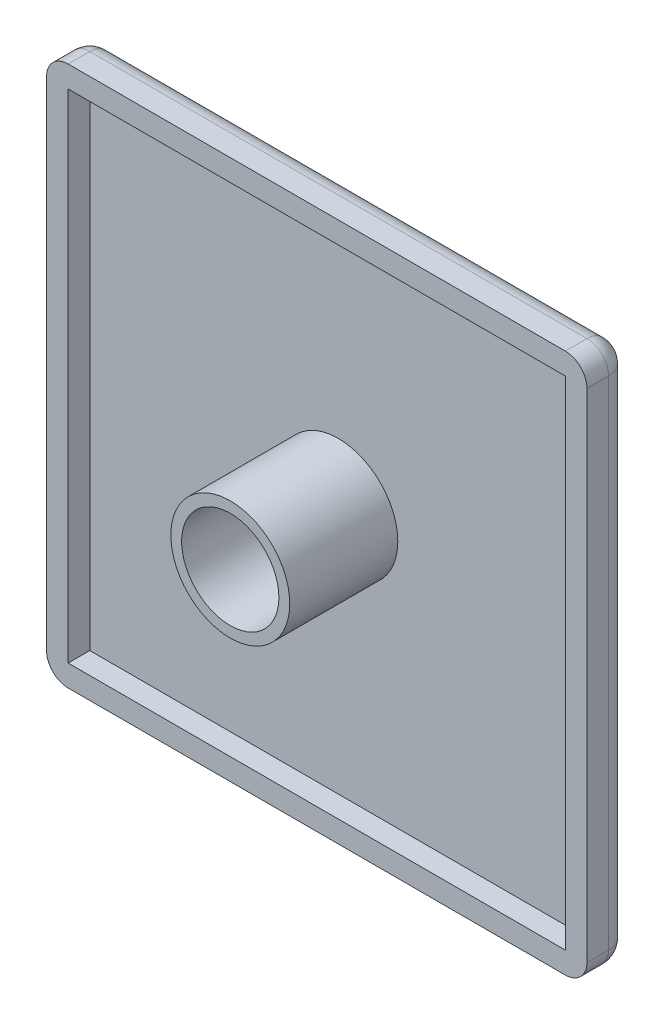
ISO-10303-21;
HEADER;
FILE_DESCRIPTION(('STEP AP214'),'2;1');
FILE_NAME('part.step','',(''),(''),'','','');
FILE_SCHEMA(('AUTOMOTIVE_DESIGN { 1 0 10303 214 1 1 1 1 }'));
ENDSEC;
DATA;
#1=APPLICATION_CONTEXT('core data for automotive mechanical design processes');
#2=APPLICATION_PROTOCOL_DEFINITION('international standard','automotive_design',2000,#1);
#3=PRODUCT_CONTEXT('',#1,'mechanical');
#4=PRODUCT('Part','Part','',(#3));
#5=PRODUCT_RELATED_PRODUCT_CATEGORY('part','',(#4));
#6=PRODUCT_DEFINITION_FORMATION('','',#4);
#7=PRODUCT_DEFINITION_CONTEXT('part definition',#1,'design');
#8=PRODUCT_DEFINITION('design','',#6,#7);
#9=PRODUCT_DEFINITION_SHAPE('','',#8);
#10=(LENGTH_UNIT() NAMED_UNIT(*) SI_UNIT(.MILLI.,.METRE.));
#11=(NAMED_UNIT(*) PLANE_ANGLE_UNIT() SI_UNIT($,.RADIAN.));
#12=(NAMED_UNIT(*) SI_UNIT($,.STERADIAN.) SOLID_ANGLE_UNIT());
#13=UNCERTAINTY_MEASURE_WITH_UNIT(LENGTH_MEASURE(1.E-05),#10,'distance_accuracy_value','');
#14=(GEOMETRIC_REPRESENTATION_CONTEXT(3) GLOBAL_UNCERTAINTY_ASSIGNED_CONTEXT((#13)) GLOBAL_UNIT_ASSIGNED_CONTEXT((#10,
#11,#12)) REPRESENTATION_CONTEXT('',''));
#15=CARTESIAN_POINT('',(0.,0.,0.));
#16=DIRECTION('',(0.,0.,1.));
#17=DIRECTION('',(1.,0.,0.));
#18=AXIS2_PLACEMENT_3D('',#15,#16,#17);
#19=CARTESIAN_POINT('',(0.,0.,0.));
#20=DIRECTION('',(0.,0.,1.));
#21=DIRECTION('',(1.,0.,0.));
#22=AXIS2_PLACEMENT_3D('',#19,#20,#21);
#23=PLANE('',#22);
#24=DIRECTION('',(1.,0.,0.));
#25=VECTOR('',#24,1.);
#26=CARTESIAN_POINT('',(-25.,-23.,0.));
#27=LINE('',#26,#25);
#28=CARTESIAN_POINT('',(-23.,-23.,0.));
#29=VERTEX_POINT('',#28);
#30=CARTESIAN_POINT('',(23.,-23.,0.));
#31=VERTEX_POINT('',#30);
#32=EDGE_CURVE('E133',#29,#31,#27,.T.);
#33=ORIENTED_EDGE('',*,*,#32,.T.);
#34=DIRECTION('',(0.,-1.,0.));
#35=VECTOR('',#34,1.);
#36=CARTESIAN_POINT('',(23.,0.,0.));
#37=LINE('',#36,#35);
#38=CARTESIAN_POINT('',(23.,23.,0.));
#39=VERTEX_POINT('',#38);
#40=EDGE_CURVE('E162',#39,#31,#37,.T.);
#41=ORIENTED_EDGE('',*,*,#40,.F.);
#42=DIRECTION('',(1.,0.,0.));
#43=VECTOR('',#42,1.);
#44=CARTESIAN_POINT('',(0.,23.,0.));
#45=LINE('',#44,#43);
#46=CARTESIAN_POINT('',(-23.,23.,0.));
#47=VERTEX_POINT('',#46);
#48=EDGE_CURVE('E142',#47,#39,#45,.T.);
#49=ORIENTED_EDGE('',*,*,#48,.F.);
#50=DIRECTION('',(0.,-1.,0.));
#51=VECTOR('',#50,1.);
#52=CARTESIAN_POINT('',(-23.,25.,0.));
#53=LINE('',#52,#51);
#54=EDGE_CURVE('E146',#47,#29,#53,.T.);
#55=ORIENTED_EDGE('',*,*,#54,.T.);
#56=EDGE_LOOP('',(#33,#41,#49,#55));
#57=FACE_BOUND('',#56,.T.);
#58=CARTESIAN_POINT('',(0.,0.,0.));
#59=DIRECTION('',(0.,0.,1.));
#60=DIRECTION('',(1.,0.,0.));
#61=AXIS2_PLACEMENT_3D('',#58,#59,#60);
#62=CIRCLE('',#61,5.5);
#63=CARTESIAN_POINT('',(5.5,0.,0.));
#64=VERTEX_POINT('',#63);
#65=EDGE_CURVE('E478',#64,#64,#62,.T.);
#66=ORIENTED_EDGE('',*,*,#65,.F.);
#67=EDGE_LOOP('',(#66));
#68=FACE_BOUND('',#67,.T.);
#69=ADVANCED_FACE('F33',(#57,#68),#23,.T.);
#70=CARTESIAN_POINT('',(-25.,25.,2.));
#71=DIRECTION('',(1.,0.,0.));
#72=DIRECTION('',(0.,1.,0.));
#73=AXIS2_PLACEMENT_3D('',#70,#71,#72);
#74=PLANE('',#73);
#75=DIRECTION('',(0.,-1.,0.));
#76=VECTOR('',#75,1.);
#77=CARTESIAN_POINT('',(-25.,25.,2.));
#78=LINE('',#77,#76);
#79=CARTESIAN_POINT('',(-25.,23.,2.));
#80=VERTEX_POINT('',#79);
#81=CARTESIAN_POINT('',(-25.,-23.,2.));
#82=VERTEX_POINT('',#81);
#83=EDGE_CURVE('E174',#80,#82,#78,.T.);
#84=ORIENTED_EDGE('',*,*,#83,.F.);
#85=DIRECTION('',(0.,0.,-1.));
#86=VECTOR('',#85,1.);
#87=CARTESIAN_POINT('',(-25.,23.,2.));
#88=LINE('',#87,#86);
#89=CARTESIAN_POINT('',(-25.,23.,0.));
#90=VERTEX_POINT('',#89);
#91=EDGE_CURVE('E191',#80,#90,#88,.T.);
#92=ORIENTED_EDGE('',*,*,#91,.T.);
#93=DIRECTION('',(0.,-1.,0.));
#94=VECTOR('',#93,1.);
#95=CARTESIAN_POINT('',(-25.,25.,0.));
#96=LINE('',#95,#94);
#97=CARTESIAN_POINT('',(-25.,-23.,0.));
#98=VERTEX_POINT('',#97);
#99=EDGE_CURVE('E187',#90,#98,#96,.T.);
#100=ORIENTED_EDGE('',*,*,#99,.T.);
#101=DIRECTION('',(0.,0.,-1.));
#102=VECTOR('',#101,1.);
#103=CARTESIAN_POINT('',(-25.,-23.,2.));
#104=LINE('',#103,#102);
#105=EDGE_CURVE('E189',#98,#82,#104,.F.);
#106=ORIENTED_EDGE('',*,*,#105,.T.);
#107=EDGE_LOOP('',(#84,#92,#100,#106));
#108=FACE_BOUND('',#107,.T.);
#109=ADVANCED_FACE('F323',(#108),#74,.F.);
#110=CARTESIAN_POINT('',(-25.,-25.,2.));
#111=DIRECTION('',(0.,1.,0.));
#112=DIRECTION('',(0.,0.,1.));
#113=AXIS2_PLACEMENT_3D('',#110,#111,#112);
#114=PLANE('',#113);
#115=DIRECTION('',(1.,0.,0.));
#116=VECTOR('',#115,1.);
#117=CARTESIAN_POINT('',(-25.,-25.,2.));
#118=LINE('',#117,#116);
#119=CARTESIAN_POINT('',(-23.,-25.,2.));
#120=VERTEX_POINT('',#119);
#121=CARTESIAN_POINT('',(23.,-25.,2.));
#122=VERTEX_POINT('',#121);
#123=EDGE_CURVE('E177',#120,#122,#118,.T.);
#124=ORIENTED_EDGE('',*,*,#123,.F.);
#125=DIRECTION('',(0.,0.,-1.));
#126=VECTOR('',#125,1.);
#127=CARTESIAN_POINT('',(-23.,-25.,2.));
#128=LINE('',#127,#126);
#129=CARTESIAN_POINT('',(-23.,-25.,0.));
#130=VERTEX_POINT('',#129);
#131=EDGE_CURVE('E212',#120,#130,#128,.T.);
#132=ORIENTED_EDGE('',*,*,#131,.T.);
#133=DIRECTION('',(1.,0.,0.));
#134=VECTOR('',#133,1.);
#135=CARTESIAN_POINT('',(-25.,-25.,0.));
#136=LINE('',#135,#134);
#137=CARTESIAN_POINT('',(23.,-25.,0.));
#138=VERTEX_POINT('',#137);
#139=EDGE_CURVE('E210',#130,#138,#136,.T.);
#140=ORIENTED_EDGE('',*,*,#139,.T.);
#141=DIRECTION('',(0.,0.,-1.));
#142=VECTOR('',#141,1.);
#143=CARTESIAN_POINT('',(23.,-25.,2.));
#144=LINE('',#143,#142);
#145=EDGE_CURVE('E208',#138,#122,#144,.F.);
#146=ORIENTED_EDGE('',*,*,#145,.T.);
#147=EDGE_LOOP('',(#124,#132,#140,#146));
#148=FACE_BOUND('',#147,.T.);
#149=ADVANCED_FACE('F297',(#148),#114,.F.);
#150=CARTESIAN_POINT('',(25.,25.,2.));
#151=DIRECTION('',(-1.,0.,0.));
#152=DIRECTION('',(0.,-1.,0.));
#153=AXIS2_PLACEMENT_3D('',#150,#151,#152);
#154=PLANE('',#153);
#155=DIRECTION('',(0.,1.,0.));
#156=VECTOR('',#155,1.);
#157=CARTESIAN_POINT('',(25.,25.,2.));
#158=LINE('',#157,#156);
#159=CARTESIAN_POINT('',(25.,-23.,2.));
#160=VERTEX_POINT('',#159);
#161=CARTESIAN_POINT('',(25.,23.,2.));
#162=VERTEX_POINT('',#161);
#163=EDGE_CURVE('E181',#160,#162,#158,.T.);
#164=ORIENTED_EDGE('',*,*,#163,.F.);
#165=DIRECTION('',(0.,0.,-1.));
#166=VECTOR('',#165,1.);
#167=CARTESIAN_POINT('',(25.,-23.,2.));
#168=LINE('',#167,#166);
#169=CARTESIAN_POINT('',(25.,-23.,0.));
#170=VERTEX_POINT('',#169);
#171=EDGE_CURVE('E41',#160,#170,#168,.T.);
#172=ORIENTED_EDGE('',*,*,#171,.T.);
#173=DIRECTION('',(0.,1.,0.));
#174=VECTOR('',#173,1.);
#175=CARTESIAN_POINT('',(25.,25.,0.));
#176=LINE('',#175,#174);
#177=CARTESIAN_POINT('',(25.,23.,0.));
#178=VERTEX_POINT('',#177);
#179=EDGE_CURVE('E56',#170,#178,#176,.T.);
#180=ORIENTED_EDGE('',*,*,#179,.T.);
#181=DIRECTION('',(0.,0.,-1.));
#182=VECTOR('',#181,1.);
#183=CARTESIAN_POINT('',(25.,23.,2.));
#184=LINE('',#183,#182);
#185=EDGE_CURVE('E224',#178,#162,#184,.F.);
#186=ORIENTED_EDGE('',*,*,#185,.T.);
#187=EDGE_LOOP('',(#164,#172,#180,#186));
#188=FACE_BOUND('',#187,.T.);
#189=ADVANCED_FACE('F290',(#188),#154,.F.);
#190=CARTESIAN_POINT('',(-25.,25.,2.));
#191=DIRECTION('',(0.,-1.,0.));
#192=DIRECTION('',(0.,0.,-1.));
#193=AXIS2_PLACEMENT_3D('',#190,#191,#192);
#194=PLANE('',#193);
#195=DIRECTION('',(-1.,0.,0.));
#196=VECTOR('',#195,1.);
#197=CARTESIAN_POINT('',(-25.,25.,0.));
#198=LINE('',#197,#196);
#199=CARTESIAN_POINT('',(23.,25.,0.));
#200=VERTEX_POINT('',#199);
#201=CARTESIAN_POINT('',(-23.,25.,0.));
#202=VERTEX_POINT('',#201);
#203=EDGE_CURVE('E194',#200,#202,#198,.T.);
#204=ORIENTED_EDGE('',*,*,#203,.T.);
#205=DIRECTION('',(0.,0.,-1.));
#206=VECTOR('',#205,1.);
#207=CARTESIAN_POINT('',(-23.,25.,2.));
#208=LINE('',#207,#206);
#209=CARTESIAN_POINT('',(-23.,25.,2.));
#210=VERTEX_POINT('',#209);
#211=EDGE_CURVE('E198',#202,#210,#208,.F.);
#212=ORIENTED_EDGE('',*,*,#211,.T.);
#213=DIRECTION('',(-1.,0.,0.));
#214=VECTOR('',#213,1.);
#215=CARTESIAN_POINT('',(-25.,25.,2.));
#216=LINE('',#215,#214);
#217=CARTESIAN_POINT('',(23.,25.,2.));
#218=VERTEX_POINT('',#217);
#219=EDGE_CURVE('E184',#218,#210,#216,.T.);
#220=ORIENTED_EDGE('',*,*,#219,.F.);
#221=DIRECTION('',(0.,0.,-1.));
#222=VECTOR('',#221,1.);
#223=CARTESIAN_POINT('',(23.,25.,2.));
#224=LINE('',#223,#222);
#225=EDGE_CURVE('E196',#218,#200,#224,.T.);
#226=ORIENTED_EDGE('',*,*,#225,.T.);
#227=EDGE_LOOP('',(#204,#212,#220,#226));
#228=FACE_BOUND('',#227,.T.);
#229=ADVANCED_FACE('F316',(#228),#194,.F.);
#230=CARTESIAN_POINT('',(0.,0.,2.));
#231=DIRECTION('',(0.,0.,1.));
#232=DIRECTION('',(1.,0.,0.));
#233=AXIS2_PLACEMENT_3D('',#230,#231,#232);
#234=PLANE('',#233);
#235=DIRECTION('',(-1.,0.,0.));
#236=VECTOR('',#235,1.);
#237=CARTESIAN_POINT('',(-25.,23.,2.));
#238=LINE('',#237,#236);
#239=CARTESIAN_POINT('',(23.,23.,2.));
#240=VERTEX_POINT('',#239);
#241=CARTESIAN_POINT('',(-23.,23.,2.));
#242=VERTEX_POINT('',#241);
#243=EDGE_CURVE('E151',#240,#242,#238,.T.);
#244=ORIENTED_EDGE('',*,*,#243,.F.);
#245=DIRECTION('',(0.,1.,0.));
#246=VECTOR('',#245,1.);
#247=CARTESIAN_POINT('',(23.,25.,2.));
#248=LINE('',#247,#246);
#249=CARTESIAN_POINT('',(23.,-23.,2.));
#250=VERTEX_POINT('',#249);
#251=EDGE_CURVE('E169',#250,#240,#248,.T.);
#252=ORIENTED_EDGE('',*,*,#251,.F.);
#253=DIRECTION('',(1.,0.,0.));
#254=VECTOR('',#253,1.);
#255=CARTESIAN_POINT('',(-25.,-23.,2.));
#256=LINE('',#255,#254);
#257=CARTESIAN_POINT('',(-23.,-23.,2.));
#258=VERTEX_POINT('',#257);
#259=EDGE_CURVE('E48',#258,#250,#256,.T.);
#260=ORIENTED_EDGE('',*,*,#259,.F.);
#261=DIRECTION('',(0.,-1.,0.));
#262=VECTOR('',#261,1.);
#263=CARTESIAN_POINT('',(-23.,25.,2.));
#264=LINE('',#263,#262);
#265=EDGE_CURVE('E155',#242,#258,#264,.T.);
#266=ORIENTED_EDGE('',*,*,#265,.F.);
#267=EDGE_LOOP('',(#244,#252,#260,#266));
#268=FACE_BOUND('',#267,.T.);
#269=ORIENTED_EDGE('',*,*,#219,.T.);
#270=CARTESIAN_POINT('',(-23.,23.,2.));
#271=DIRECTION('',(0.,0.,1.));
#272=DIRECTION('',(1.,0.,0.));
#273=AXIS2_PLACEMENT_3D('',#270,#271,#272);
#274=CIRCLE('',#273,2.);
#275=EDGE_CURVE('E206',#210,#80,#274,.T.);
#276=ORIENTED_EDGE('',*,*,#275,.T.);
#277=ORIENTED_EDGE('',*,*,#83,.T.);
#278=CARTESIAN_POINT('',(-23.,-23.,2.));
#279=DIRECTION('',(0.,0.,1.));
#280=DIRECTION('',(1.,0.,0.));
#281=AXIS2_PLACEMENT_3D('',#278,#279,#280);
#282=CIRCLE('',#281,2.);
#283=EDGE_CURVE('E204',#82,#120,#282,.T.);
#284=ORIENTED_EDGE('',*,*,#283,.T.);
#285=ORIENTED_EDGE('',*,*,#123,.T.);
#286=CARTESIAN_POINT('',(23.,-23.,2.));
#287=DIRECTION('',(0.,0.,1.));
#288=DIRECTION('',(1.,0.,0.));
#289=AXIS2_PLACEMENT_3D('',#286,#287,#288);
#290=CIRCLE('',#289,2.);
#291=EDGE_CURVE('E202',#122,#160,#290,.T.);
#292=ORIENTED_EDGE('',*,*,#291,.T.);
#293=ORIENTED_EDGE('',*,*,#163,.T.);
#294=CARTESIAN_POINT('',(23.,23.,2.));
#295=DIRECTION('',(0.,0.,1.));
#296=DIRECTION('',(1.,0.,0.));
#297=AXIS2_PLACEMENT_3D('',#294,#295,#296);
#298=CIRCLE('',#297,2.);
#299=EDGE_CURVE('E200',#162,#218,#298,.T.);
#300=ORIENTED_EDGE('',*,*,#299,.T.);
#301=EDGE_LOOP('',(#269,#276,#277,#284,#285,#292,#293,#300));
#302=FACE_BOUND('',#301,.T.);
#303=ADVANCED_FACE('F292',(#268,#302),#234,.T.);
#304=CARTESIAN_POINT('',(0.,0.,-2.));
#305=DIRECTION('',(0.,0.,1.));
#306=DIRECTION('',(1.,0.,0.));
#307=AXIS2_PLACEMENT_3D('',#304,#305,#306);
#308=PLANE('',#307);
#309=DIRECTION('',(1.,0.,0.));
#310=VECTOR('',#309,1.);
#311=CARTESIAN_POINT('',(0.,-23.,-2.));
#312=LINE('',#311,#310);
#313=CARTESIAN_POINT('',(23.,-23.,-2.));
#314=VERTEX_POINT('',#313);
#315=CARTESIAN_POINT('',(-23.,-23.,-2.));
#316=VERTEX_POINT('',#315);
#317=EDGE_CURVE('E218',#314,#316,#312,.F.);
#318=ORIENTED_EDGE('',*,*,#317,.T.);
#319=DIRECTION('',(0.,-1.,0.));
#320=VECTOR('',#319,1.);
#321=CARTESIAN_POINT('',(-23.,0.,-2.));
#322=LINE('',#321,#320);
#323=CARTESIAN_POINT('',(-23.,23.,-2.));
#324=VERTEX_POINT('',#323);
#325=EDGE_CURVE('E220',#316,#324,#322,.F.);
#326=ORIENTED_EDGE('',*,*,#325,.T.);
#327=DIRECTION('',(-1.,0.,0.));
#328=VECTOR('',#327,1.);
#329=CARTESIAN_POINT('',(0.,23.,-2.));
#330=LINE('',#329,#328);
#331=CARTESIAN_POINT('',(23.,23.,-2.));
#332=VERTEX_POINT('',#331);
#333=EDGE_CURVE('E214',#324,#332,#330,.F.);
#334=ORIENTED_EDGE('',*,*,#333,.T.);
#335=DIRECTION('',(0.,1.,0.));
#336=VECTOR('',#335,1.);
#337=CARTESIAN_POINT('',(23.,0.,-2.));
#338=LINE('',#337,#336);
#339=EDGE_CURVE('E216',#332,#314,#338,.F.);
#340=ORIENTED_EDGE('',*,*,#339,.T.);
#341=EDGE_LOOP('',(#318,#326,#334,#340));
#342=FACE_BOUND('',#341,.T.);
#343=ADVANCED_FACE('F273',(#342),#308,.F.);
#344=CARTESIAN_POINT('',(23.,-23.,2.));
#345=DIRECTION('',(0.,0.,-1.));
#346=DIRECTION('',(-1.,0.,0.));
#347=AXIS2_PLACEMENT_3D('',#344,#345,#346);
#348=CYLINDRICAL_SURFACE('',#347,2.);
#349=CARTESIAN_POINT('',(23.,-23.,0.));
#350=DIRECTION('',(0.,0.,-1.));
#351=DIRECTION('',(-1.,0.,0.));
#352=AXIS2_PLACEMENT_3D('',#349,#350,#351);
#353=CIRCLE('',#352,2.);
#354=EDGE_CURVE('E178',#170,#138,#353,.T.);
#355=ORIENTED_EDGE('',*,*,#354,.F.);
#356=ORIENTED_EDGE('',*,*,#171,.F.);
#357=ORIENTED_EDGE('',*,*,#291,.F.);
#358=ORIENTED_EDGE('',*,*,#145,.F.);
#359=EDGE_LOOP('',(#355,#356,#357,#358));
#360=FACE_BOUND('',#359,.T.);
#361=ADVANCED_FACE('F35',(#360),#348,.T.);
#362=CARTESIAN_POINT('',(23.,-23.,0.));
#363=DIRECTION('',(0.,0.,1.));
#364=DIRECTION('',(1.,0.,0.));
#365=AXIS2_PLACEMENT_3D('',#362,#363,#364);
#366=SPHERICAL_SURFACE('',#365,2.);
#367=CARTESIAN_POINT('',(23.,-23.,0.));
#368=DIRECTION('',(0.,-1.,0.));
#369=DIRECTION('',(0.,0.,-1.));
#370=AXIS2_PLACEMENT_3D('',#367,#368,#369);
#371=CIRCLE('',#370,2.);
#372=EDGE_CURVE('E251',#170,#314,#371,.F.);
#373=ORIENTED_EDGE('',*,*,#372,.F.);
#374=ORIENTED_EDGE('',*,*,#354,.T.);
#375=CARTESIAN_POINT('',(23.,-23.,0.));
#376=DIRECTION('',(1.,0.,0.));
#377=DIRECTION('',(0.,0.,-1.));
#378=AXIS2_PLACEMENT_3D('',#375,#376,#377);
#379=CIRCLE('',#378,2.);
#380=EDGE_CURVE('E254',#314,#138,#379,.F.);
#381=ORIENTED_EDGE('',*,*,#380,.F.);
#382=EDGE_LOOP('',(#373,#374,#381));
#383=FACE_BOUND('',#382,.T.);
#384=ADVANCED_FACE('F261',(#383),#366,.T.);
#385=CARTESIAN_POINT('',(-23.,-23.,2.));
#386=DIRECTION('',(0.,0.,-1.));
#387=DIRECTION('',(-1.,0.,0.));
#388=AXIS2_PLACEMENT_3D('',#385,#386,#387);
#389=CYLINDRICAL_SURFACE('',#388,2.);
#390=ORIENTED_EDGE('',*,*,#283,.F.);
#391=ORIENTED_EDGE('',*,*,#105,.F.);
#392=CARTESIAN_POINT('',(-23.,-23.,0.));
#393=DIRECTION('',(0.,0.,-1.));
#394=DIRECTION('',(-1.,0.,0.));
#395=AXIS2_PLACEMENT_3D('',#392,#393,#394);
#396=CIRCLE('',#395,2.);
#397=EDGE_CURVE('E248',#130,#98,#396,.T.);
#398=ORIENTED_EDGE('',*,*,#397,.F.);
#399=ORIENTED_EDGE('',*,*,#131,.F.);
#400=EDGE_LOOP('',(#390,#391,#398,#399));
#401=FACE_BOUND('',#400,.T.);
#402=ADVANCED_FACE('F301',(#401),#389,.T.);
#403=CARTESIAN_POINT('',(-25.,-23.,0.));
#404=DIRECTION('',(1.,0.,0.));
#405=DIRECTION('',(0.,0.,-1.));
#406=AXIS2_PLACEMENT_3D('',#403,#404,#405);
#407=CYLINDRICAL_SURFACE('',#406,2.);
#408=ORIENTED_EDGE('',*,*,#380,.T.);
#409=ORIENTED_EDGE('',*,*,#139,.F.);
#410=CARTESIAN_POINT('',(-23.,-23.,0.));
#411=DIRECTION('',(-1.,0.,0.));
#412=DIRECTION('',(0.,0.,1.));
#413=AXIS2_PLACEMENT_3D('',#410,#411,#412);
#414=CIRCLE('',#413,2.);
#415=EDGE_CURVE('E245',#316,#130,#414,.T.);
#416=ORIENTED_EDGE('',*,*,#415,.F.);
#417=ORIENTED_EDGE('',*,*,#317,.F.);
#418=EDGE_LOOP('',(#408,#409,#416,#417));
#419=FACE_BOUND('',#418,.T.);
#420=ADVANCED_FACE('F268',(#419),#407,.T.);
#421=CARTESIAN_POINT('',(23.,25.,0.));
#422=DIRECTION('',(0.,1.,0.));
#423=DIRECTION('',(-1.,0.,0.));
#424=AXIS2_PLACEMENT_3D('',#421,#422,#423);
#425=CYLINDRICAL_SURFACE('',#424,2.);
#426=ORIENTED_EDGE('',*,*,#372,.T.);
#427=ORIENTED_EDGE('',*,*,#339,.F.);
#428=CARTESIAN_POINT('',(23.,23.,0.));
#429=DIRECTION('',(0.,1.,0.));
#430=DIRECTION('',(0.,0.,1.));
#431=AXIS2_PLACEMENT_3D('',#428,#429,#430);
#432=CIRCLE('',#431,2.);
#433=EDGE_CURVE('E242',#178,#332,#432,.T.);
#434=ORIENTED_EDGE('',*,*,#433,.F.);
#435=ORIENTED_EDGE('',*,*,#179,.F.);
#436=EDGE_LOOP('',(#426,#427,#434,#435));
#437=FACE_BOUND('',#436,.T.);
#438=ADVANCED_FACE('F279',(#437),#425,.T.);
#439=CARTESIAN_POINT('',(23.,23.,2.));
#440=DIRECTION('',(0.,0.,-1.));
#441=DIRECTION('',(-1.,0.,0.));
#442=AXIS2_PLACEMENT_3D('',#439,#440,#441);
#443=CYLINDRICAL_SURFACE('',#442,2.);
#444=ORIENTED_EDGE('',*,*,#299,.F.);
#445=ORIENTED_EDGE('',*,*,#185,.F.);
#446=CARTESIAN_POINT('',(23.,23.,0.));
#447=DIRECTION('',(0.,0.,-1.));
#448=DIRECTION('',(-1.,0.,0.));
#449=AXIS2_PLACEMENT_3D('',#446,#447,#448);
#450=CIRCLE('',#449,2.);
#451=EDGE_CURVE('E239',#200,#178,#450,.T.);
#452=ORIENTED_EDGE('',*,*,#451,.F.);
#453=ORIENTED_EDGE('',*,*,#225,.F.);
#454=EDGE_LOOP('',(#444,#445,#452,#453));
#455=FACE_BOUND('',#454,.T.);
#456=ADVANCED_FACE('F288',(#455),#443,.T.);
#457=CARTESIAN_POINT('',(-23.,-23.,0.));
#458=DIRECTION('',(0.,0.,1.));
#459=DIRECTION('',(1.,0.,0.));
#460=AXIS2_PLACEMENT_3D('',#457,#458,#459);
#461=SPHERICAL_SURFACE('',#460,2.);
#462=ORIENTED_EDGE('',*,*,#415,.T.);
#463=ORIENTED_EDGE('',*,*,#397,.T.);
#464=CARTESIAN_POINT('',(-23.,-23.,0.));
#465=DIRECTION('',(0.,-1.,0.));
#466=DIRECTION('',(0.,0.,-1.));
#467=AXIS2_PLACEMENT_3D('',#464,#465,#466);
#468=CIRCLE('',#467,2.);
#469=EDGE_CURVE('E236',#316,#98,#468,.F.);
#470=ORIENTED_EDGE('',*,*,#469,.F.);
#471=EDGE_LOOP('',(#462,#463,#470));
#472=FACE_BOUND('',#471,.T.);
#473=ADVANCED_FACE('F304',(#472),#461,.T.);
#474=CARTESIAN_POINT('',(23.,23.,0.));
#475=DIRECTION('',(0.,0.,1.));
#476=DIRECTION('',(1.,0.,0.));
#477=AXIS2_PLACEMENT_3D('',#474,#475,#476);
#478=SPHERICAL_SURFACE('',#477,2.);
#479=ORIENTED_EDGE('',*,*,#451,.T.);
#480=ORIENTED_EDGE('',*,*,#433,.T.);
#481=CARTESIAN_POINT('',(23.,23.,0.));
#482=DIRECTION('',(1.,0.,0.));
#483=DIRECTION('',(0.,1.,0.));
#484=AXIS2_PLACEMENT_3D('',#481,#482,#483);
#485=CIRCLE('',#484,2.);
#486=EDGE_CURVE('E233',#200,#332,#485,.F.);
#487=ORIENTED_EDGE('',*,*,#486,.F.);
#488=EDGE_LOOP('',(#479,#480,#487));
#489=FACE_BOUND('',#488,.T.);
#490=ADVANCED_FACE('F283',(#489),#478,.T.);
#491=CARTESIAN_POINT('',(-23.,25.,0.));
#492=DIRECTION('',(0.,-1.,0.));
#493=DIRECTION('',(1.,0.,0.));
#494=AXIS2_PLACEMENT_3D('',#491,#492,#493);
#495=CYLINDRICAL_SURFACE('',#494,2.);
#496=ORIENTED_EDGE('',*,*,#469,.T.);
#497=ORIENTED_EDGE('',*,*,#99,.F.);
#498=CARTESIAN_POINT('',(-23.,23.,0.));
#499=DIRECTION('',(0.,1.,0.));
#500=DIRECTION('',(0.,0.,1.));
#501=AXIS2_PLACEMENT_3D('',#498,#499,#500);
#502=CIRCLE('',#501,2.);
#503=EDGE_CURVE('E230',#324,#90,#502,.T.);
#504=ORIENTED_EDGE('',*,*,#503,.F.);
#505=ORIENTED_EDGE('',*,*,#325,.F.);
#506=EDGE_LOOP('',(#496,#497,#504,#505));
#507=FACE_BOUND('',#506,.T.);
#508=ADVANCED_FACE('F308',(#507),#495,.T.);
#509=CARTESIAN_POINT('',(-25.,23.,0.));
#510=DIRECTION('',(-1.,0.,0.));
#511=DIRECTION('',(0.,0.,1.));
#512=AXIS2_PLACEMENT_3D('',#509,#510,#511);
#513=CYLINDRICAL_SURFACE('',#512,2.);
#514=ORIENTED_EDGE('',*,*,#486,.T.);
#515=ORIENTED_EDGE('',*,*,#333,.F.);
#516=CARTESIAN_POINT('',(-23.,23.,0.));
#517=DIRECTION('',(-1.,0.,0.));
#518=DIRECTION('',(0.,0.,1.));
#519=AXIS2_PLACEMENT_3D('',#516,#517,#518);
#520=CIRCLE('',#519,2.);
#521=EDGE_CURVE('E228',#202,#324,#520,.T.);
#522=ORIENTED_EDGE('',*,*,#521,.F.);
#523=ORIENTED_EDGE('',*,*,#203,.F.);
#524=EDGE_LOOP('',(#514,#515,#522,#523));
#525=FACE_BOUND('',#524,.T.);
#526=ADVANCED_FACE('F313',(#525),#513,.T.);
#527=CARTESIAN_POINT('',(-23.,23.,0.));
#528=DIRECTION('',(0.,0.,1.));
#529=DIRECTION('',(1.,0.,0.));
#530=AXIS2_PLACEMENT_3D('',#527,#528,#529);
#531=SPHERICAL_SURFACE('',#530,2.);
#532=ORIENTED_EDGE('',*,*,#521,.T.);
#533=ORIENTED_EDGE('',*,*,#503,.T.);
#534=CARTESIAN_POINT('',(-23.,23.,0.));
#535=DIRECTION('',(0.,0.,-1.));
#536=DIRECTION('',(-1.,0.,0.));
#537=AXIS2_PLACEMENT_3D('',#534,#535,#536);
#538=CIRCLE('',#537,2.);
#539=EDGE_CURVE('E160',#202,#90,#538,.F.);
#540=ORIENTED_EDGE('',*,*,#539,.F.);
#541=EDGE_LOOP('',(#532,#533,#540));
#542=FACE_BOUND('',#541,.T.);
#543=ADVANCED_FACE('F337',(#542),#531,.T.);
#544=CARTESIAN_POINT('',(-23.,23.,2.));
#545=DIRECTION('',(0.,0.,-1.));
#546=DIRECTION('',(-1.,0.,0.));
#547=AXIS2_PLACEMENT_3D('',#544,#545,#546);
#548=CYLINDRICAL_SURFACE('',#547,2.);
#549=ORIENTED_EDGE('',*,*,#275,.F.);
#550=ORIENTED_EDGE('',*,*,#211,.F.);
#551=ORIENTED_EDGE('',*,*,#539,.T.);
#552=ORIENTED_EDGE('',*,*,#91,.F.);
#553=EDGE_LOOP('',(#549,#550,#551,#552));
#554=FACE_BOUND('',#553,.T.);
#555=ADVANCED_FACE('F321',(#554),#548,.T.);
#556=CARTESIAN_POINT('',(-23.,25.,2.));
#557=DIRECTION('',(1.,0.,0.));
#558=DIRECTION('',(0.,1.,0.));
#559=AXIS2_PLACEMENT_3D('',#556,#557,#558);
#560=PLANE('',#559);
#561=ORIENTED_EDGE('',*,*,#265,.T.);
#562=DIRECTION('',(0.,0.,1.));
#563=VECTOR('',#562,1.);
#564=CARTESIAN_POINT('',(-23.,-23.,2.));
#565=LINE('',#564,#563);
#566=EDGE_CURVE('E137',#29,#258,#565,.T.);
#567=ORIENTED_EDGE('',*,*,#566,.F.);
#568=ORIENTED_EDGE('',*,*,#54,.F.);
#569=DIRECTION('',(0.,0.,1.));
#570=VECTOR('',#569,1.);
#571=CARTESIAN_POINT('',(-23.,23.,2.));
#572=LINE('',#571,#570);
#573=EDGE_CURVE('E143',#47,#242,#572,.T.);
#574=ORIENTED_EDGE('',*,*,#573,.T.);
#575=EDGE_LOOP('',(#561,#567,#568,#574));
#576=FACE_BOUND('',#575,.T.);
#577=ADVANCED_FACE('F153',(#576),#560,.T.);
#578=CARTESIAN_POINT('',(-25.,-23.,2.));
#579=DIRECTION('',(0.,1.,0.));
#580=DIRECTION('',(0.,0.,1.));
#581=AXIS2_PLACEMENT_3D('',#578,#579,#580);
#582=PLANE('',#581);
#583=ORIENTED_EDGE('',*,*,#259,.T.);
#584=DIRECTION('',(0.,0.,-1.));
#585=VECTOR('',#584,1.);
#586=CARTESIAN_POINT('',(23.,-23.,2.));
#587=LINE('',#586,#585);
#588=EDGE_CURVE('E139',#250,#31,#587,.T.);
#589=ORIENTED_EDGE('',*,*,#588,.T.);
#590=ORIENTED_EDGE('',*,*,#32,.F.);
#591=ORIENTED_EDGE('',*,*,#566,.T.);
#592=EDGE_LOOP('',(#583,#589,#590,#591));
#593=FACE_BOUND('',#592,.T.);
#594=ADVANCED_FACE('F135',(#593),#582,.T.);
#595=CARTESIAN_POINT('',(23.,25.,2.));
#596=DIRECTION('',(-1.,0.,0.));
#597=DIRECTION('',(0.,-1.,0.));
#598=AXIS2_PLACEMENT_3D('',#595,#596,#597);
#599=PLANE('',#598);
#600=ORIENTED_EDGE('',*,*,#251,.T.);
#601=DIRECTION('',(0.,0.,1.));
#602=VECTOR('',#601,1.);
#603=CARTESIAN_POINT('',(23.,23.,2.));
#604=LINE('',#603,#602);
#605=EDGE_CURVE('E161',#39,#240,#604,.T.);
#606=ORIENTED_EDGE('',*,*,#605,.F.);
#607=ORIENTED_EDGE('',*,*,#40,.T.);
#608=ORIENTED_EDGE('',*,*,#588,.F.);
#609=EDGE_LOOP('',(#600,#606,#607,#608));
#610=FACE_BOUND('',#609,.T.);
#611=ADVANCED_FACE('F405',(#610),#599,.T.);
#612=CARTESIAN_POINT('',(-25.,23.,2.));
#613=DIRECTION('',(0.,-1.,0.));
#614=DIRECTION('',(0.,0.,-1.));
#615=AXIS2_PLACEMENT_3D('',#612,#613,#614);
#616=PLANE('',#615);
#617=ORIENTED_EDGE('',*,*,#48,.T.);
#618=ORIENTED_EDGE('',*,*,#605,.T.);
#619=ORIENTED_EDGE('',*,*,#243,.T.);
#620=ORIENTED_EDGE('',*,*,#573,.F.);
#621=EDGE_LOOP('',(#617,#618,#619,#620));
#622=FACE_BOUND('',#621,.T.);
#623=ADVANCED_FACE('F414',(#622),#616,.T.);
#624=CARTESIAN_POINT('',(0.,0.,10.));
#625=DIRECTION('',(0.,0.,1.));
#626=DIRECTION('',(1.,0.,0.));
#627=AXIS2_PLACEMENT_3D('',#624,#625,#626);
#628=PLANE('',#627);
#629=CARTESIAN_POINT('',(0.,0.,10.));
#630=DIRECTION('',(0.,0.,1.));
#631=DIRECTION('',(1.,0.,0.));
#632=AXIS2_PLACEMENT_3D('',#629,#630,#631);
#633=CIRCLE('',#632,5.5);
#634=CARTESIAN_POINT('',(5.5,0.,10.));
#635=VERTEX_POINT('',#634);
#636=EDGE_CURVE('E167',#635,#635,#633,.T.);
#637=ORIENTED_EDGE('',*,*,#636,.T.);
#638=EDGE_LOOP('',(#637));
#639=FACE_BOUND('',#638,.T.);
#640=CARTESIAN_POINT('',(0.,0.,10.));
#641=DIRECTION('',(0.,0.,1.));
#642=DIRECTION('',(1.,0.,0.));
#643=AXIS2_PLACEMENT_3D('',#640,#641,#642);
#644=CIRCLE('',#643,4.5);
#645=CARTESIAN_POINT('',(4.5,0.,10.));
#646=VERTEX_POINT('',#645);
#647=EDGE_CURVE('E476',#646,#646,#644,.T.);
#648=ORIENTED_EDGE('',*,*,#647,.F.);
#649=EDGE_LOOP('',(#648));
#650=FACE_BOUND('',#649,.T.);
#651=ADVANCED_FACE('F424',(#639,#650),#628,.T.);
#652=CARTESIAN_POINT('',(0.,0.,10.));
#653=DIRECTION('',(0.,0.,-1.));
#654=DIRECTION('',(-1.,0.,0.));
#655=AXIS2_PLACEMENT_3D('',#652,#653,#654);
#656=CYLINDRICAL_SURFACE('',#655,5.5);
#657=ORIENTED_EDGE('',*,*,#636,.F.);
#658=EDGE_LOOP('',(#657));
#659=FACE_BOUND('',#658,.T.);
#660=ORIENTED_EDGE('',*,*,#65,.T.);
#661=EDGE_LOOP('',(#660));
#662=FACE_BOUND('',#661,.T.);
#663=ADVANCED_FACE('F441',(#659,#662),#656,.T.);
#664=CARTESIAN_POINT('',(0.,0.,10.));
#665=DIRECTION('',(0.,0.,-1.));
#666=DIRECTION('',(-1.,0.,0.));
#667=AXIS2_PLACEMENT_3D('',#664,#665,#666);
#668=CYLINDRICAL_SURFACE('',#667,4.5);
#669=ORIENTED_EDGE('',*,*,#647,.T.);
#670=EDGE_LOOP('',(#669));
#671=FACE_BOUND('',#670,.T.);
#672=CARTESIAN_POINT('',(0.,0.,0.));
#673=DIRECTION('',(0.,0.,1.));
#674=DIRECTION('',(1.,0.,0.));
#675=AXIS2_PLACEMENT_3D('',#672,#673,#674);
#676=CIRCLE('',#675,4.5);
#677=CARTESIAN_POINT('',(4.5,0.,0.));
#678=VERTEX_POINT('',#677);
#679=EDGE_CURVE('E11',#678,#678,#676,.F.);
#680=ORIENTED_EDGE('',*,*,#679,.T.);
#681=EDGE_LOOP('',(#680));
#682=FACE_BOUND('',#681,.T.);
#683=ADVANCED_FACE('F451',(#671,#682),#668,.F.);
#684=ORIENTED_EDGE('',*,*,#679,.F.);
#685=EDGE_LOOP('',(#684));
#686=FACE_BOUND('',#685,.T.);
#687=ADVANCED_FACE('F332',(#686),#23,.T.);
#688=CLOSED_SHELL('',(#69,#109,#149,#189,#229,#303,#343,#361,#384,#402,#420,#438,#456,#473,#490,
#508,#526,#543,#555,#577,#594,#611,#623,#651,#663,#683,#687));
#689=MANIFOLD_SOLID_BREP('B2',#688);
#690=ADVANCED_BREP_SHAPE_REPRESENTATION('',(#18,#689),#14);
#691=SHAPE_DEFINITION_REPRESENTATION(#9,#690);
ENDSEC;
END-ISO-10303-21;
